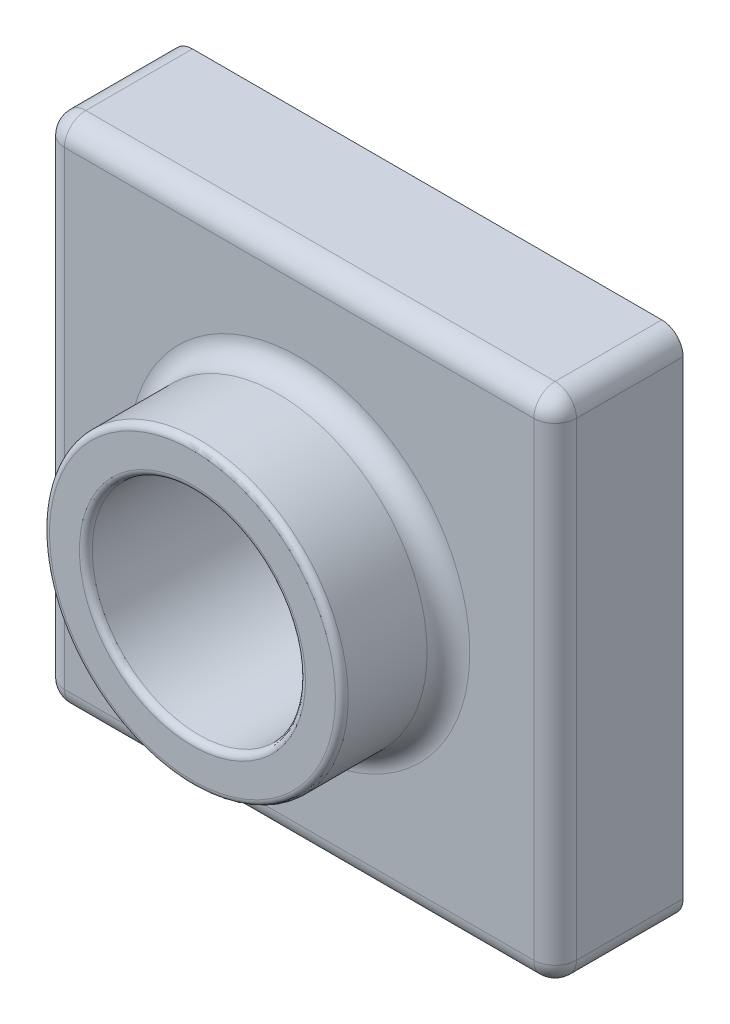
from build123d import *

# Parameters (mm, degrees)
SKETCH1_W           = 120
SKETCH1_H           = 120
BOSS_EXTRUDE1_DEPTH = 30
SKETCH2_R           = 35
BOSS_EXTRUDE2_DEPTH = 25
SKETCH3_R           = 25
CUT_EXTRUDE1_DEPTH  = 179.395627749
FILLET1_R           = 5
FILLET2_R           = 1.5
SHELL1_T            = -2


with BuildPart() as part:
    # Sketch1 → Boss-Extrude1 (new body)
    with BuildSketch(Plane.XY):
        with Locations((60, 60)):
            Rectangle(SKETCH1_W, SKETCH1_H)
    extrude(amount=BOSS_EXTRUDE1_DEPTH)

    # Sketch2 → Boss-Extrude2 (add)
    with BuildSketch(Plane.XY.offset(30)):
        with Locations(Location((60, 60, 0), (0, 0, 180))):
            Circle(SKETCH2_R)
    extrude(amount=BOSS_EXTRUDE2_DEPTH)

    # Sketch3 → Cut-Extrude1 (cut, through all)
    with BuildSketch(Plane.XY.offset(55)):
        with Locations((60, 60)):
            Circle(SKETCH3_R)
    extrude(amount=-CUT_EXTRUDE1_DEPTH, mode=Mode.SUBTRACT)

    # Fillet1
    fillet1_edges = [part.edges().sort_by_distance(p)[0] for p in [
        (120, 60, 30),
        (60, 120, 30),
        (95, 60, 30),
        (0, 60, 30),
        (60, 0, 30),
        (0, 120, 15),
        (120, 120, 15),
        (120, 0, 15),
        (0, 0, 15),
    ]]
    fillet(fillet1_edges, radius=FILLET1_R)

    # Fillet2
    fillet2_edges = [part.edges().sort_by_distance(p)[0] for p in [
        (95, 60, 55),
        (35, 60, 55),
    ]]
    fillet(fillet2_edges, radius=FILLET2_R)

    # Shell1
    shell1_openings = [part.faces().sort_by_distance(p)[0] for p in [
        (60, 1.697056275, 0),
    ]]
    offset(amount=SHELL1_T, openings=shell1_openings, kind=Kind.INTERSECTION)


solid = part.part
